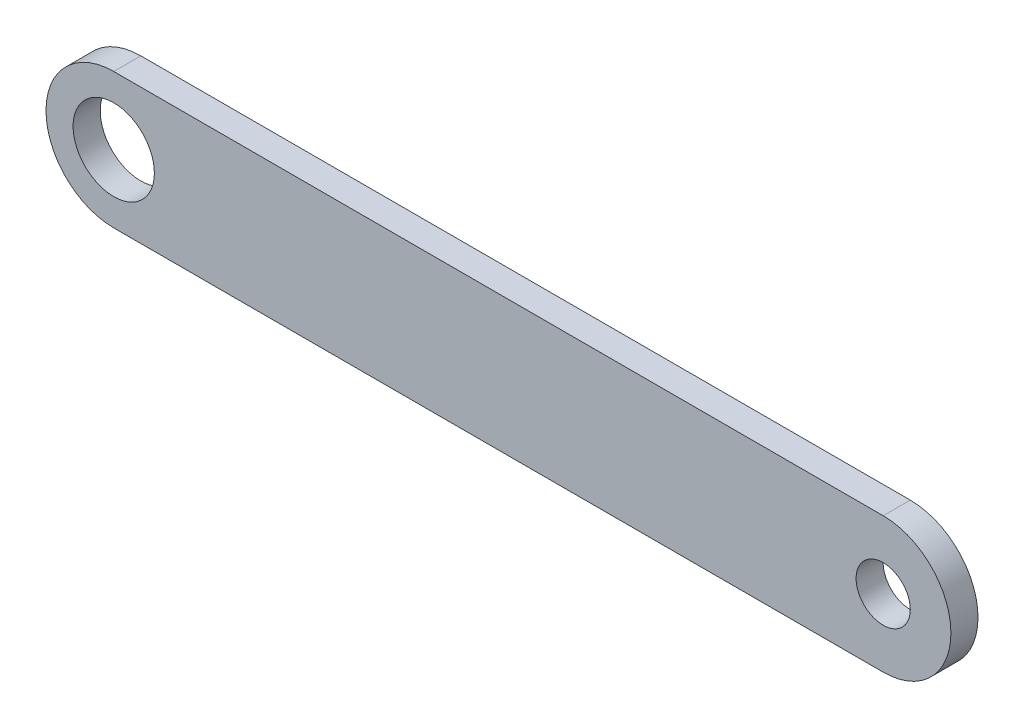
from build123d import *

# Parameters (mm, degrees)
BOSS_EXTRUDE1_DEPTH   = 5
M14_CLEARANCE_HOLE1_D = 15
M8_CLEARANCE_HOLE1_D  = 10


with BuildPart() as part:
    # Sketch1 → Boss-Extrude1 (new body)
    with BuildSketch(Plane.XY):
        with BuildLine():
            Line((-71, 12.5), (71, 12.5))
            ThreePointArc((71, 12.5), (83.5, 0), (71, -12.5))
            Line((71, -12.5), (-71, -12.5))
            ThreePointArc((-71, -12.5), (-83.5, 0), (-71, 12.5))
        make_face()
    extrude(amount=BOSS_EXTRUDE1_DEPTH)

    # M14 Clearance Hole1 (through all)
    with Locations(Plane.XY.offset(5)):
        with Locations((-71, 0)):
            Hole(M14_CLEARANCE_HOLE1_D / 2)

    # M8 Clearance Hole1 (through all)
    with Locations(Plane.XY.offset(5)):
        with Locations((71, 0)):
            Hole(M8_CLEARANCE_HOLE1_D / 2)


solid = part.part
